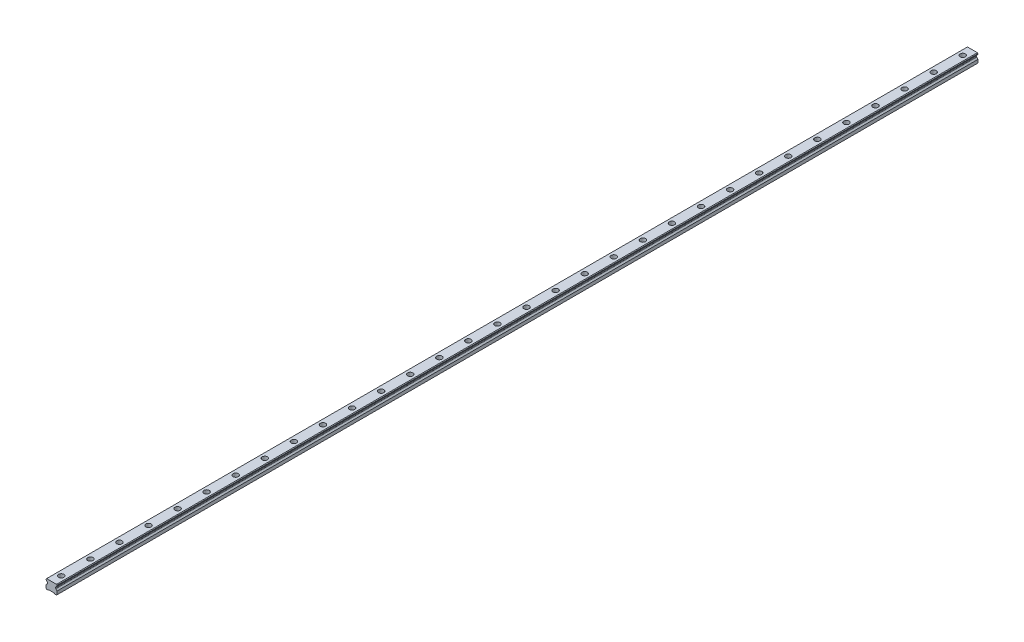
from build123d import *

# Parameters (mm, degrees)
SKETCH1_W           = 23
SKETCH1_H           = 19.2
BOSS_EXTRUDE1_DEPTH = 950
CUT_EXTRUDE1_DEPTH  = 1901.131808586
CHAMFER1_SIZE       = 1.25
FILLET1_R           = 1.25
CUT_EXTRUDE2_DEPTH  = 1901.131808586
SKETCH4_R           = 5.5
SKETCH4_R_2         = 3.5
CUT_EXTRUDE3_DEPTH  = 9
SKETCH4_2_R         = 3.5
CUT_EXTRUDE4_DEPTH  = 951.263589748
LPATTERN1_COUNT     = 32
LPATTERN1_PITCH     = 60


with BuildPart() as part:
    # Sketch1 → Boss-Extrude1 (new, symmetric)
    with BuildSketch(Plane.XY):
        with Locations((0, 9.6)):
            Rectangle(SKETCH1_W, SKETCH1_H)
    extrude(amount=BOSS_EXTRUDE1_DEPTH, both=True)

    # Sketch2 → Cut-Extrude1 (cut, through all)
    with BuildSketch(Plane.XY.offset(950)):
        Polygon((-11.5, 16.7), (-11.5, 7.95), (-8.583333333, 10.866666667), (-8.583333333, 13.783333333), align=None)
        Polygon((8.583333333, 13.783333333), (11.5, 16.7), (11.5, 7.95), (8.583333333, 10.866666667), align=None)
    extrude(amount=-CUT_EXTRUDE1_DEPTH, mode=Mode.SUBTRACT)

    # Chamfer1
    chamfer1_edges = [part.edges().sort_by_distance(p)[0] for p in [
        (-11.5, 19.2, 0),
        (11.5, 19.2, 0),
        (11.5, 0, 0),
        (-11.5, 0, 0),
    ]]
    chamfer(chamfer1_edges, length=CHAMFER1_SIZE)

    # Fillet1
    fillet1_edges = [part.edges().sort_by_distance(p)[0] for p in [
        (-8.583333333, 13.783333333, 0),
        (-8.583333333, 10.866666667, 0),
        (8.583333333, 10.866666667, 0),
        (8.583333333, 13.783333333, 0),
    ]]
    fillet(fillet1_edges, radius=FILLET1_R)

    # Sketch3 → Cut-Extrude2 (cut, through all)
    with BuildSketch(Plane.XY.offset(950)):
        Polygon((-7, 0), (-5.75, 1.25), (5.75, 1.25), (7, 0), align=None)
    extrude(amount=-CUT_EXTRUDE2_DEPTH, mode=Mode.SUBTRACT)

    # Sketch4 → Cut-Extrude3 (cut)
    with BuildSketch(Plane(origin=(0, 19.2, 0), x_dir=(1, 0, 0), z_dir=(0, 1, 0))):
        with Locations(Location((0, -930, 0), (0, 0, 270))):
            Circle(SKETCH4_R)
        with Locations(Location((0, -930, 0), (0, 0, 270))):
            Circle(SKETCH4_R_2, mode=Mode.SUBTRACT)
    cut_extrude3 = extrude(amount=-CUT_EXTRUDE3_DEPTH, mode=Mode.SUBTRACT)

    # Sketch4_2 → Cut-Extrude4 (cut, through all)
    with BuildSketch(Plane(origin=(0, 19.2, 0), x_dir=(1, 0, 0), z_dir=(0, 1, 0))):
        with Locations(Location((0, -930, 0), (0, 0, 270))):
            Circle(SKETCH4_2_R)
    cut_extrude4 = extrude(amount=-CUT_EXTRUDE4_DEPTH, mode=Mode.SUBTRACT)

    # LPattern1: Cut-Extrude3, Cut-Extrude4 ×32
    with Locations(*[(0, 0, -i * LPATTERN1_PITCH) for i in range(1, LPATTERN1_COUNT)]):
        add(cut_extrude3, mode=Mode.SUBTRACT)
        add(cut_extrude4, mode=Mode.SUBTRACT)


solid = part.part
